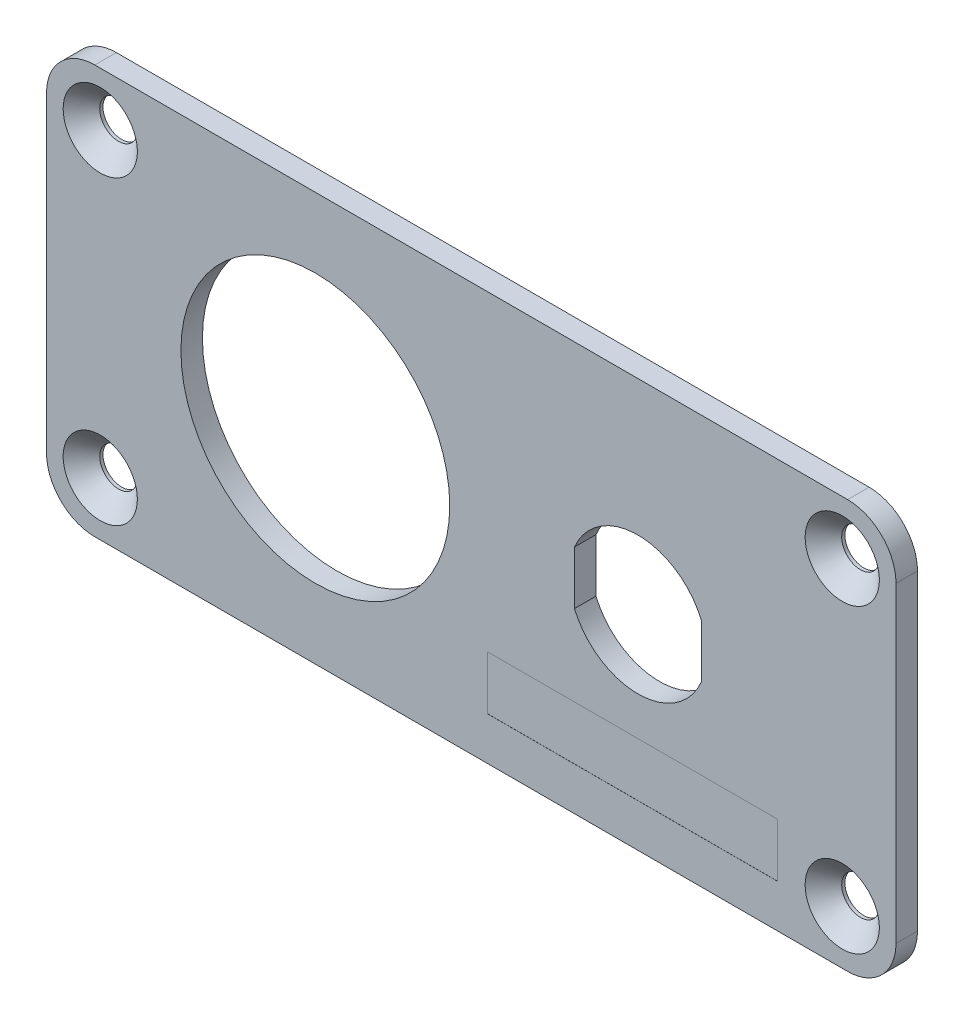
from build123d import *

# Parameters (mm, degrees)
CROQUIS1_W              = 79
CROQUIS1_H              = 38
SALIENTE_EXTRUIR1_DEPTH = 2
REDONDEO1_R             = 4.5
CROQUIS2_R              = 1.75
CORTAR_EXTRUIR1_DEPTH   = 88.686943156
CROQUIS3_R              = 12.5
CORTAR_EXTRUIR2_DEPTH   = 2
CHAFL_N1_SIZE           = 1.7
CROQUIS5_W              = 27
CROQUIS5_H              = 5
CORTAR_EXTRUIR3_DEPTH   = 0.01


with BuildPart() as part:
    # Croquis1 → Saliente-Extruir1 (new body)
    with BuildSketch(Plane.XY):
        with Locations((39.5, 19)):
            Rectangle(CROQUIS1_W, CROQUIS1_H)
    extrude(amount=SALIENTE_EXTRUIR1_DEPTH)

    # Redondeo1
    redondeo1_edges = [part.edges().sort_by_distance(p)[0] for p in [
        (0, 38, 1),
        (79, 38, 1),
        (79, 0, 1),
        (0, 0, 1),
    ]]
    fillet(redondeo1_edges, radius=REDONDEO1_R)

    # Croquis2 → Cortar-Extruir1 (cut, through all)
    with BuildSketch(Plane.XY.offset(2)):
        with Locations((5, 33)):
            Circle(CROQUIS2_R)
        with Locations((5, 5)):
            Circle(CROQUIS2_R)
        with Locations((74, 33)):
            Circle(CROQUIS2_R)
        with Locations((74, 5)):
            Circle(CROQUIS2_R)
    extrude(amount=-CORTAR_EXTRUIR1_DEPTH, mode=Mode.SUBTRACT)

    # Croquis3 → Cortar-Extruir2 (cut)
    with BuildSketch(Plane.XY.offset(2)):
        with Locations((25, 19)):
            Circle(CROQUIS3_R)
        with BuildLine():
            Line((49.1, 21.479919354), (49.1, 16.520080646))
            ThreePointArc((49.1, 16.520080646), (55, 12.6), (60.9, 16.520080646))
            Line((60.9, 16.520080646), (60.9, 21.479919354))
            ThreePointArc((60.9, 21.479919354), (55, 25.4), (49.1, 21.479919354))
        make_face()
    extrude(amount=-CORTAR_EXTRUIR2_DEPTH, mode=Mode.SUBTRACT)

    # Chafl_n1
    chafl_n1_edges = [part.edges().sort_by_distance(p)[0] for p in [
        (3.25, 5, 2),
        (72.25, 33, 2),
        (72.25, 5, 2),
        (3.25, 33, 2),
    ]]
    chamfer(chafl_n1_edges, length=CHAFL_N1_SIZE)

    # Croquis5 → Cortar-Extruir3 (cut)
    with BuildSketch(Plane.XY.offset(2)):
        with Locations((54.5, 6.5)):
            Rectangle(CROQUIS5_W, CROQUIS5_H)
    extrude(amount=-CORTAR_EXTRUIR3_DEPTH, mode=Mode.SUBTRACT)


solid = part.part
